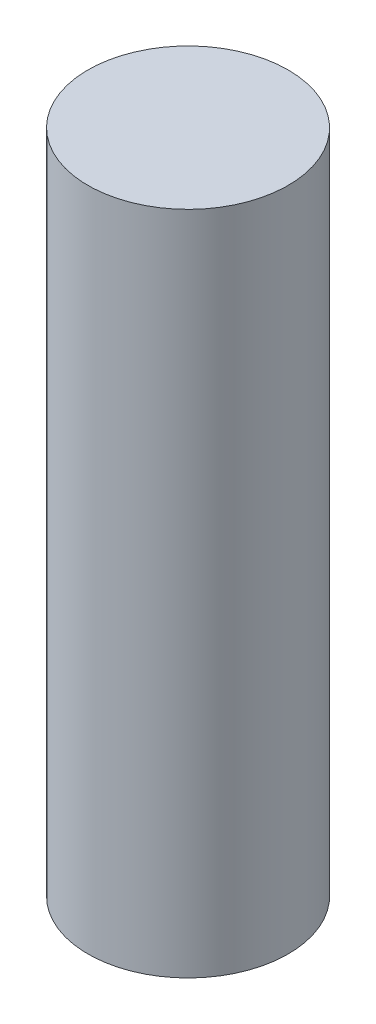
ISO-10303-21;
HEADER;
FILE_DESCRIPTION(('STEP AP214'),'2;1');
FILE_NAME('part.step','',(''),(''),'','','');
FILE_SCHEMA(('AUTOMOTIVE_DESIGN { 1 0 10303 214 1 1 1 1 }'));
ENDSEC;
DATA;
#1=APPLICATION_CONTEXT('core data for automotive mechanical design processes');
#2=APPLICATION_PROTOCOL_DEFINITION('international standard','automotive_design',2000,#1);
#3=PRODUCT_CONTEXT('',#1,'mechanical');
#4=PRODUCT('Part','Part','',(#3));
#5=PRODUCT_RELATED_PRODUCT_CATEGORY('part','',(#4));
#6=PRODUCT_DEFINITION_FORMATION('','',#4);
#7=PRODUCT_DEFINITION_CONTEXT('part definition',#1,'design');
#8=PRODUCT_DEFINITION('design','',#6,#7);
#9=PRODUCT_DEFINITION_SHAPE('','',#8);
#10=(LENGTH_UNIT() NAMED_UNIT(*) SI_UNIT(.MILLI.,.METRE.));
#11=(NAMED_UNIT(*) PLANE_ANGLE_UNIT() SI_UNIT($,.RADIAN.));
#12=(NAMED_UNIT(*) SI_UNIT($,.STERADIAN.) SOLID_ANGLE_UNIT());
#13=UNCERTAINTY_MEASURE_WITH_UNIT(LENGTH_MEASURE(1.E-05),#10,'distance_accuracy_value','');
#14=(GEOMETRIC_REPRESENTATION_CONTEXT(3) GLOBAL_UNCERTAINTY_ASSIGNED_CONTEXT((#13)) GLOBAL_UNIT_ASSIGNED_CONTEXT((#10,
#11,#12)) REPRESENTATION_CONTEXT('',''));
#15=CARTESIAN_POINT('',(0.,0.,0.));
#16=DIRECTION('',(0.,0.,1.));
#17=DIRECTION('',(1.,0.,0.));
#18=AXIS2_PLACEMENT_3D('',#15,#16,#17);
#19=CARTESIAN_POINT('',(0.,111.4,0.));
#20=DIRECTION('',(0.,-1.,0.));
#21=DIRECTION('',(0.,0.,-1.00000000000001));
#22=AXIS2_PLACEMENT_3D('',#19,#20,#21);
#23=PLANE('',#22);
#24=CARTESIAN_POINT('',(0.,111.4,0.));
#25=DIRECTION('',(0.,-1.,0.));
#26=DIRECTION('',(0.,0.,-1.00000000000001));
#27=AXIS2_PLACEMENT_3D('',#24,#25,#26);
#28=CIRCLE('',#27,16.75);
#29=CARTESIAN_POINT('',(0.,111.4,-16.7500000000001));
#30=VERTEX_POINT('',#29);
#31=EDGE_CURVE('E10',#30,#30,#28,.T.);
#32=ORIENTED_EDGE('',*,*,#31,.F.);
#33=EDGE_LOOP('',(#32));
#34=FACE_BOUND('',#33,.T.);
#35=ADVANCED_FACE('F36',(#34),#23,.F.);
#36=CARTESIAN_POINT('',(0.,0.,0.));
#37=DIRECTION('',(0.,-1.,0.));
#38=DIRECTION('',(0.,0.,-1.00000000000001));
#39=AXIS2_PLACEMENT_3D('',#36,#37,#38);
#40=CYLINDRICAL_SURFACE('',#39,16.75);
#41=CARTESIAN_POINT('',(0.,0.,0.));
#42=DIRECTION('',(0.,-1.,0.));
#43=DIRECTION('',(0.,0.,-1.00000000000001));
#44=AXIS2_PLACEMENT_3D('',#41,#42,#43);
#45=CIRCLE('',#44,16.75);
#46=CARTESIAN_POINT('',(0.,0.,-16.7500000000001));
#47=VERTEX_POINT('',#46);
#48=EDGE_CURVE('E43',#47,#47,#45,.T.);
#49=ORIENTED_EDGE('',*,*,#48,.F.);
#50=EDGE_LOOP('',(#49));
#51=FACE_BOUND('',#50,.T.);
#52=ORIENTED_EDGE('',*,*,#31,.T.);
#53=EDGE_LOOP('',(#52));
#54=FACE_BOUND('',#53,.T.);
#55=ADVANCED_FACE('F52',(#51,#54),#40,.T.);
#56=CARTESIAN_POINT('',(-16.7500000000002,0.,0.));
#57=DIRECTION('',(0.,1.,0.));
#58=DIRECTION('',(0.,0.,1.00000000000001));
#59=AXIS2_PLACEMENT_3D('',#56,#57,#58);
#60=PLANE('',#59);
#61=ORIENTED_EDGE('',*,*,#48,.T.);
#62=EDGE_LOOP('',(#61));
#63=FACE_BOUND('',#62,.T.);
#64=ADVANCED_FACE('F50',(#63),#60,.F.);
#65=CLOSED_SHELL('',(#35,#55,#64));
#66=MANIFOLD_SOLID_BREP('B2',#65);
#67=ADVANCED_BREP_SHAPE_REPRESENTATION('',(#18,#66),#14);
#68=SHAPE_DEFINITION_REPRESENTATION(#9,#67);
ENDSEC;
END-ISO-10303-21;
